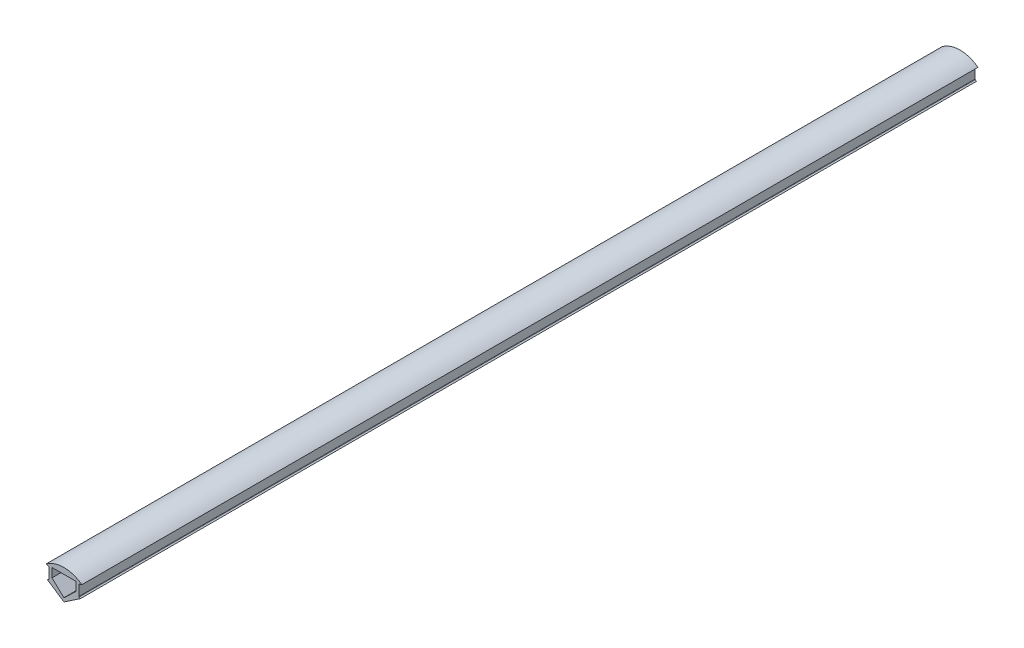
ISO-10303-21;
HEADER;
FILE_DESCRIPTION(('STEP AP214'),'2;1');
FILE_NAME('part.step','',(''),(''),'','','');
FILE_SCHEMA(('AUTOMOTIVE_DESIGN { 1 0 10303 214 1 1 1 1 }'));
ENDSEC;
DATA;
#1=APPLICATION_CONTEXT('core data for automotive mechanical design processes');
#2=APPLICATION_PROTOCOL_DEFINITION('international standard','automotive_design',2000,#1);
#3=PRODUCT_CONTEXT('',#1,'mechanical');
#4=PRODUCT('Part','Part','',(#3));
#5=PRODUCT_RELATED_PRODUCT_CATEGORY('part','',(#4));
#6=PRODUCT_DEFINITION_FORMATION('','',#4);
#7=PRODUCT_DEFINITION_CONTEXT('part definition',#1,'design');
#8=PRODUCT_DEFINITION('design','',#6,#7);
#9=PRODUCT_DEFINITION_SHAPE('','',#8);
#10=(LENGTH_UNIT() NAMED_UNIT(*) SI_UNIT(.MILLI.,.METRE.));
#11=(NAMED_UNIT(*) PLANE_ANGLE_UNIT() SI_UNIT($,.RADIAN.));
#12=(NAMED_UNIT(*) SI_UNIT($,.STERADIAN.) SOLID_ANGLE_UNIT());
#13=UNCERTAINTY_MEASURE_WITH_UNIT(LENGTH_MEASURE(1.E-05),#10,'distance_accuracy_value','');
#14=(GEOMETRIC_REPRESENTATION_CONTEXT(3) GLOBAL_UNCERTAINTY_ASSIGNED_CONTEXT((#13)) GLOBAL_UNIT_ASSIGNED_CONTEXT((#10,
#11,#12)) REPRESENTATION_CONTEXT('',''));
#15=CARTESIAN_POINT('',(0.,0.,0.));
#16=DIRECTION('',(0.,0.,1.));
#17=DIRECTION('',(1.,0.,0.));
#18=AXIS2_PLACEMENT_3D('',#15,#16,#17);
#19=CARTESIAN_POINT('',(5.19999999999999,-0.889002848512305,150.));
#20=DIRECTION('',(0.,0.,1.));
#21=DIRECTION('',(1.,0.,0.));
#22=AXIS2_PLACEMENT_3D('',#19,#20,#21);
#23=PLANE('',#22);
#24=DIRECTION('',(0.,1.,0.));
#25=VECTOR('',#24,1.);
#26=CARTESIAN_POINT('',(4.99999999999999,2.54825155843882,150.));
#27=LINE('',#26,#25);
#28=CARTESIAN_POINT('',(4.99999999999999,-0.889002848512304,150.));
#29=VERTEX_POINT('',#28);
#30=CARTESIAN_POINT('',(4.99999999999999,2.54825155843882,150.));
#31=VERTEX_POINT('',#30);
#32=EDGE_CURVE('E206',#29,#31,#27,.T.);
#33=ORIENTED_EDGE('',*,*,#32,.T.);
#34=CARTESIAN_POINT('',(5.19999999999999,2.54825155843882,150.));
#35=DIRECTION('',(0.,0.,-1.));
#36=DIRECTION('',(-1.,0.,0.));
#37=AXIS2_PLACEMENT_3D('',#34,#35,#36);
#38=CIRCLE('',#37,0.2);
#39=CARTESIAN_POINT('',(5.14192843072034,2.73963518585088,150.));
#40=VERTEX_POINT('',#39);
#41=EDGE_CURVE('E209',#31,#40,#38,.T.);
#42=ORIENTED_EDGE('',*,*,#41,.T.);
#43=DIRECTION('',(0.956918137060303,0.290357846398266,0.));
#44=VECTOR('',#43,1.);
#45=CARTESIAN_POINT('',(6.00000000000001,3.,150.));
#46=LINE('',#45,#44);
#47=CARTESIAN_POINT('',(6.00000000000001,3.,150.));
#48=VERTEX_POINT('',#47);
#49=EDGE_CURVE('E212',#40,#48,#46,.T.);
#50=ORIENTED_EDGE('',*,*,#49,.T.);
#51=CARTESIAN_POINT('',(0.,-5.,150.));
#52=DIRECTION('',(0.,0.,1.));
#53=DIRECTION('',(1.,0.,0.));
#54=AXIS2_PLACEMENT_3D('',#51,#52,#53);
#55=CIRCLE('',#54,10.);
#56=CARTESIAN_POINT('',(-5.99999999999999,2.99999999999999,150.));
#57=VERTEX_POINT('',#56);
#58=EDGE_CURVE('E214',#48,#57,#55,.T.);
#59=ORIENTED_EDGE('',*,*,#58,.T.);
#60=DIRECTION('',(0.956918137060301,-0.290357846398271,0.));
#61=VECTOR('',#60,1.);
#62=CARTESIAN_POINT('',(-5.99999999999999,2.99999999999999,150.));
#63=LINE('',#62,#61);
#64=CARTESIAN_POINT('',(-5.14192843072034,2.73963518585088,150.));
#65=VERTEX_POINT('',#64);
#66=EDGE_CURVE('E216',#57,#65,#63,.T.);
#67=ORIENTED_EDGE('',*,*,#66,.T.);
#68=CARTESIAN_POINT('',(-5.19999999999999,2.54825155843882,150.));
#69=DIRECTION('',(0.,0.,-1.));
#70=DIRECTION('',(1.,0.,0.));
#71=AXIS2_PLACEMENT_3D('',#68,#69,#70);
#72=CIRCLE('',#71,0.2);
#73=CARTESIAN_POINT('',(-4.99999999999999,2.54825155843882,150.));
#74=VERTEX_POINT('',#73);
#75=EDGE_CURVE('E218',#65,#74,#72,.T.);
#76=ORIENTED_EDGE('',*,*,#75,.T.);
#77=DIRECTION('',(0.,-1.,0.));
#78=VECTOR('',#77,1.);
#79=CARTESIAN_POINT('',(-4.99999999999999,2.54825155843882,150.));
#80=LINE('',#79,#78);
#81=CARTESIAN_POINT('',(-4.99999999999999,-0.889002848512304,150.));
#82=VERTEX_POINT('',#81);
#83=EDGE_CURVE('E220',#74,#82,#80,.T.);
#84=ORIENTED_EDGE('',*,*,#83,.T.);
#85=CARTESIAN_POINT('',(-5.19999999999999,-0.889002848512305,150.));
#86=DIRECTION('',(0.,0.,-1.));
#87=DIRECTION('',(1.,0.,0.));
#88=AXIS2_PLACEMENT_3D('',#85,#86,#87);
#89=CIRCLE('',#88,0.2);
#90=CARTESIAN_POINT('',(-5.09419175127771,-1.05872207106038,150.));
#91=VERTEX_POINT('',#90);
#92=EDGE_CURVE('E222',#82,#91,#89,.T.);
#93=ORIENTED_EDGE('',*,*,#92,.T.);
#94=DIRECTION('',(-0.848596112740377,-0.529041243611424,0.));
#95=VECTOR('',#94,1.);
#96=CARTESIAN_POINT('',(-5.09419175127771,-1.05872207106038,150.));
#97=LINE('',#96,#95);
#98=CARTESIAN_POINT('',(-5.50000000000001,-1.31171557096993,150.));
#99=VERTEX_POINT('',#98);
#100=EDGE_CURVE('E224',#91,#99,#97,.T.);
#101=ORIENTED_EDGE('',*,*,#100,.T.);
#102=DIRECTION('',(0.830540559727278,-0.556958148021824,0.));
#103=VECTOR('',#102,1.);
#104=CARTESIAN_POINT('',(-5.50000000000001,-1.31171557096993,150.));
#105=LINE('',#104,#103);
#106=CARTESIAN_POINT('',(0.,-5.,150.));
#107=VERTEX_POINT('',#106);
#108=EDGE_CURVE('E226',#99,#107,#105,.T.);
#109=ORIENTED_EDGE('',*,*,#108,.T.);
#110=DIRECTION('',(0.830540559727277,0.556958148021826,0.));
#111=VECTOR('',#110,1.);
#112=CARTESIAN_POINT('',(5.50000000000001,-1.31171557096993,150.));
#113=LINE('',#112,#111);
#114=CARTESIAN_POINT('',(5.50000000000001,-1.31171557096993,150.));
#115=VERTEX_POINT('',#114);
#116=EDGE_CURVE('E228',#107,#115,#113,.T.);
#117=ORIENTED_EDGE('',*,*,#116,.T.);
#118=DIRECTION('',(-0.848596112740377,0.529041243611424,0.));
#119=VECTOR('',#118,1.);
#120=CARTESIAN_POINT('',(5.09419175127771,-1.05872207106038,150.));
#121=LINE('',#120,#119);
#122=CARTESIAN_POINT('',(5.09419175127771,-1.05872207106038,150.));
#123=VERTEX_POINT('',#122);
#124=EDGE_CURVE('E230',#115,#123,#121,.T.);
#125=ORIENTED_EDGE('',*,*,#124,.T.);
#126=CARTESIAN_POINT('',(5.19999999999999,-0.889002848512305,150.));
#127=DIRECTION('',(0.,0.,-1.));
#128=DIRECTION('',(1.,0.,0.));
#129=AXIS2_PLACEMENT_3D('',#126,#127,#128);
#130=CIRCLE('',#129,0.2);
#131=EDGE_CURVE('E232',#123,#29,#130,.T.);
#132=ORIENTED_EDGE('',*,*,#131,.T.);
#133=EDGE_LOOP('',(#33,#42,#50,#59,#67,#76,#84,#93,#101,#109,#117,#125,#132));
#134=FACE_BOUND('',#133,.T.);
#135=DIRECTION('',(0.729429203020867,0.684056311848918,0.));
#136=VECTOR('',#135,1.);
#137=CARTESIAN_POINT('',(4.,-0.0161479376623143,150.));
#138=LINE('',#137,#136);
#139=CARTESIAN_POINT('',(0.,-3.76733480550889,150.));
#140=VERTEX_POINT('',#139);
#141=CARTESIAN_POINT('',(4.,-0.0161479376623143,150.));
#142=VERTEX_POINT('',#141);
#143=EDGE_CURVE('E170',#140,#142,#138,.T.);
#144=ORIENTED_EDGE('',*,*,#143,.F.);
#145=DIRECTION('',(0.729429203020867,-0.684056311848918,0.));
#146=VECTOR('',#145,1.);
#147=CARTESIAN_POINT('',(-4.,-0.0161479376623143,150.));
#148=LINE('',#147,#146);
#149=CARTESIAN_POINT('',(-4.,-0.0161479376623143,150.));
#150=VERTEX_POINT('',#149);
#151=EDGE_CURVE('E162',#150,#140,#148,.T.);
#152=ORIENTED_EDGE('',*,*,#151,.F.);
#153=DIRECTION('',(0.,-1.,0.));
#154=VECTOR('',#153,1.);
#155=CARTESIAN_POINT('',(-4.,2.99999999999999,150.));
#156=LINE('',#155,#154);
#157=CARTESIAN_POINT('',(-4.,2.99999999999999,150.));
#158=VERTEX_POINT('',#157);
#159=EDGE_CURVE('E189',#158,#150,#156,.T.);
#160=ORIENTED_EDGE('',*,*,#159,.F.);
#161=DIRECTION('',(-1.,0.,0.));
#162=VECTOR('',#161,1.);
#163=CARTESIAN_POINT('',(-4.,2.99999999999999,150.));
#164=LINE('',#163,#162);
#165=CARTESIAN_POINT('',(4.,3.,150.));
#166=VERTEX_POINT('',#165);
#167=EDGE_CURVE('E185',#166,#158,#164,.T.);
#168=ORIENTED_EDGE('',*,*,#167,.F.);
#169=DIRECTION('',(0.,1.,0.));
#170=VECTOR('',#169,1.);
#171=CARTESIAN_POINT('',(4.,3.,150.));
#172=LINE('',#171,#170);
#173=EDGE_CURVE('E183',#142,#166,#172,.T.);
#174=ORIENTED_EDGE('',*,*,#173,.F.);
#175=EDGE_LOOP('',(#144,#152,#160,#168,#174));
#176=FACE_BOUND('',#175,.T.);
#177=ADVANCED_FACE('F37',(#134,#176),#23,.T.);
#178=CARTESIAN_POINT('',(5.19999999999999,-0.889002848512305,-150.));
#179=DIRECTION('',(0.,0.,1.));
#180=DIRECTION('',(1.,0.,0.));
#181=AXIS2_PLACEMENT_3D('',#178,#179,#180);
#182=PLANE('',#181);
#183=CARTESIAN_POINT('',(5.19999999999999,2.54825155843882,-150.));
#184=DIRECTION('',(0.,0.,-1.));
#185=DIRECTION('',(-1.,0.,0.));
#186=AXIS2_PLACEMENT_3D('',#183,#184,#185);
#187=CIRCLE('',#186,0.2);
#188=CARTESIAN_POINT('',(4.99999999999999,2.54825155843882,-150.));
#189=VERTEX_POINT('',#188);
#190=CARTESIAN_POINT('',(5.14192843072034,2.73963518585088,-150.));
#191=VERTEX_POINT('',#190);
#192=EDGE_CURVE('E178',#189,#191,#187,.T.);
#193=ORIENTED_EDGE('',*,*,#192,.F.);
#194=DIRECTION('',(0.,1.,0.));
#195=VECTOR('',#194,1.);
#196=CARTESIAN_POINT('',(4.99999999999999,-0.889002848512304,-150.));
#197=LINE('',#196,#195);
#198=CARTESIAN_POINT('',(4.99999999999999,-0.889002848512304,-150.));
#199=VERTEX_POINT('',#198);
#200=EDGE_CURVE('E210',#199,#189,#197,.T.);
#201=ORIENTED_EDGE('',*,*,#200,.F.);
#202=CARTESIAN_POINT('',(5.19999999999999,-0.889002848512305,-150.));
#203=DIRECTION('',(0.,0.,-1.));
#204=DIRECTION('',(1.,0.,0.));
#205=AXIS2_PLACEMENT_3D('',#202,#203,#204);
#206=CIRCLE('',#205,0.2);
#207=CARTESIAN_POINT('',(5.09419175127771,-1.05872207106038,-150.));
#208=VERTEX_POINT('',#207);
#209=EDGE_CURVE('E258',#208,#199,#206,.T.);
#210=ORIENTED_EDGE('',*,*,#209,.F.);
#211=DIRECTION('',(-0.848596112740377,0.529041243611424,0.));
#212=VECTOR('',#211,1.);
#213=CARTESIAN_POINT('',(5.09419175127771,-1.05872207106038,-150.));
#214=LINE('',#213,#212);
#215=CARTESIAN_POINT('',(5.50000000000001,-1.31171557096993,-150.));
#216=VERTEX_POINT('',#215);
#217=EDGE_CURVE('E256',#216,#208,#214,.T.);
#218=ORIENTED_EDGE('',*,*,#217,.F.);
#219=DIRECTION('',(0.830540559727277,0.556958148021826,0.));
#220=VECTOR('',#219,1.);
#221=CARTESIAN_POINT('',(5.50000000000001,-1.31171557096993,-150.));
#222=LINE('',#221,#220);
#223=CARTESIAN_POINT('',(0.,-5.,-150.));
#224=VERTEX_POINT('',#223);
#225=EDGE_CURVE('E254',#224,#216,#222,.T.);
#226=ORIENTED_EDGE('',*,*,#225,.F.);
#227=DIRECTION('',(0.830540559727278,-0.556958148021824,0.));
#228=VECTOR('',#227,1.);
#229=CARTESIAN_POINT('',(-5.50000000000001,-1.31171557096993,-150.));
#230=LINE('',#229,#228);
#231=CARTESIAN_POINT('',(-5.50000000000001,-1.31171557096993,-150.));
#232=VERTEX_POINT('',#231);
#233=EDGE_CURVE('E252',#232,#224,#230,.T.);
#234=ORIENTED_EDGE('',*,*,#233,.F.);
#235=DIRECTION('',(-0.848596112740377,-0.529041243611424,0.));
#236=VECTOR('',#235,1.);
#237=CARTESIAN_POINT('',(-5.09419175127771,-1.05872207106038,-150.));
#238=LINE('',#237,#236);
#239=CARTESIAN_POINT('',(-5.09419175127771,-1.05872207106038,-150.));
#240=VERTEX_POINT('',#239);
#241=EDGE_CURVE('E250',#240,#232,#238,.T.);
#242=ORIENTED_EDGE('',*,*,#241,.F.);
#243=CARTESIAN_POINT('',(-5.19999999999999,-0.889002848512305,-150.));
#244=DIRECTION('',(0.,0.,-1.));
#245=DIRECTION('',(1.,0.,0.));
#246=AXIS2_PLACEMENT_3D('',#243,#244,#245);
#247=CIRCLE('',#246,0.2);
#248=CARTESIAN_POINT('',(-4.99999999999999,-0.889002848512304,-150.));
#249=VERTEX_POINT('',#248);
#250=EDGE_CURVE('E248',#249,#240,#247,.T.);
#251=ORIENTED_EDGE('',*,*,#250,.F.);
#252=DIRECTION('',(0.,-1.,0.));
#253=VECTOR('',#252,1.);
#254=CARTESIAN_POINT('',(-4.99999999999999,-0.889002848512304,-150.));
#255=LINE('',#254,#253);
#256=CARTESIAN_POINT('',(-4.99999999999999,2.54825155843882,-150.));
#257=VERTEX_POINT('',#256);
#258=EDGE_CURVE('E246',#257,#249,#255,.T.);
#259=ORIENTED_EDGE('',*,*,#258,.F.);
#260=CARTESIAN_POINT('',(-5.19999999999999,2.54825155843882,-150.));
#261=DIRECTION('',(0.,0.,-1.));
#262=DIRECTION('',(1.,0.,0.));
#263=AXIS2_PLACEMENT_3D('',#260,#261,#262);
#264=CIRCLE('',#263,0.2);
#265=CARTESIAN_POINT('',(-5.14192843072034,2.73963518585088,-150.));
#266=VERTEX_POINT('',#265);
#267=EDGE_CURVE('E243',#266,#257,#264,.T.);
#268=ORIENTED_EDGE('',*,*,#267,.F.);
#269=DIRECTION('',(0.956918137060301,-0.290357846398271,0.));
#270=VECTOR('',#269,1.);
#271=CARTESIAN_POINT('',(-5.99999999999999,2.99999999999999,-150.));
#272=LINE('',#271,#270);
#273=CARTESIAN_POINT('',(-5.99999999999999,2.99999999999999,-150.));
#274=VERTEX_POINT('',#273);
#275=EDGE_CURVE('E241',#274,#266,#272,.T.);
#276=ORIENTED_EDGE('',*,*,#275,.F.);
#277=CARTESIAN_POINT('',(0.,-5.,-150.));
#278=DIRECTION('',(0.,0.,1.));
#279=DIRECTION('',(1.,0.,0.));
#280=AXIS2_PLACEMENT_3D('',#277,#278,#279);
#281=CIRCLE('',#280,10.);
#282=CARTESIAN_POINT('',(6.00000000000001,3.,-150.));
#283=VERTEX_POINT('',#282);
#284=EDGE_CURVE('E239',#283,#274,#281,.T.);
#285=ORIENTED_EDGE('',*,*,#284,.F.);
#286=DIRECTION('',(0.956918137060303,0.290357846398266,0.));
#287=VECTOR('',#286,1.);
#288=CARTESIAN_POINT('',(6.00000000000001,3.,-150.));
#289=LINE('',#288,#287);
#290=EDGE_CURVE('E237',#191,#283,#289,.T.);
#291=ORIENTED_EDGE('',*,*,#290,.F.);
#292=EDGE_LOOP('',(#193,#201,#210,#218,#226,#234,#242,#251,#259,#268,#276,#285,#291));
#293=FACE_BOUND('',#292,.T.);
#294=DIRECTION('',(0.729429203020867,-0.684056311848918,0.));
#295=VECTOR('',#294,1.);
#296=CARTESIAN_POINT('',(-4.,-0.0161479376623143,-150.));
#297=LINE('',#296,#295);
#298=CARTESIAN_POINT('',(-4.,-0.0161479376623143,-150.));
#299=VERTEX_POINT('',#298);
#300=CARTESIAN_POINT('',(0.,-3.76733480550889,-150.));
#301=VERTEX_POINT('',#300);
#302=EDGE_CURVE('E60',#299,#301,#297,.T.);
#303=ORIENTED_EDGE('',*,*,#302,.T.);
#304=DIRECTION('',(0.729429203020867,0.684056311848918,0.));
#305=VECTOR('',#304,1.);
#306=CARTESIAN_POINT('',(4.,-0.0161479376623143,-150.));
#307=LINE('',#306,#305);
#308=CARTESIAN_POINT('',(4.,-0.0161479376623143,-150.));
#309=VERTEX_POINT('',#308);
#310=EDGE_CURVE('E177',#301,#309,#307,.T.);
#311=ORIENTED_EDGE('',*,*,#310,.T.);
#312=DIRECTION('',(0.,1.,0.));
#313=VECTOR('',#312,1.);
#314=CARTESIAN_POINT('',(4.,3.,-150.));
#315=LINE('',#314,#313);
#316=CARTESIAN_POINT('',(4.,3.,-150.));
#317=VERTEX_POINT('',#316);
#318=EDGE_CURVE('E193',#309,#317,#315,.T.);
#319=ORIENTED_EDGE('',*,*,#318,.T.);
#320=DIRECTION('',(-1.,0.,0.));
#321=VECTOR('',#320,1.);
#322=CARTESIAN_POINT('',(-4.,2.99999999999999,-150.));
#323=LINE('',#322,#321);
#324=CARTESIAN_POINT('',(-4.,2.99999999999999,-150.));
#325=VERTEX_POINT('',#324);
#326=EDGE_CURVE('E196',#317,#325,#323,.T.);
#327=ORIENTED_EDGE('',*,*,#326,.T.);
#328=DIRECTION('',(0.,-1.,0.));
#329=VECTOR('',#328,1.);
#330=CARTESIAN_POINT('',(-4.,2.99999999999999,-150.));
#331=LINE('',#330,#329);
#332=EDGE_CURVE('E171',#325,#299,#331,.T.);
#333=ORIENTED_EDGE('',*,*,#332,.T.);
#334=EDGE_LOOP('',(#303,#311,#319,#327,#333));
#335=FACE_BOUND('',#334,.T.);
#336=ADVANCED_FACE('F303',(#293,#335),#182,.F.);
#337=CARTESIAN_POINT('',(5.19999999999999,2.54825155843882,150.));
#338=DIRECTION('',(0.,0.,-1.));
#339=DIRECTION('',(-1.,0.,0.));
#340=AXIS2_PLACEMENT_3D('',#337,#338,#339);
#341=CYLINDRICAL_SURFACE('',#340,0.2);
#342=ORIENTED_EDGE('',*,*,#192,.T.);
#343=DIRECTION('',(0.,0.,-1.));
#344=VECTOR('',#343,1.);
#345=CARTESIAN_POINT('',(5.14192843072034,2.73963518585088,150.));
#346=LINE('',#345,#344);
#347=EDGE_CURVE('E45',#40,#191,#346,.T.);
#348=ORIENTED_EDGE('',*,*,#347,.F.);
#349=ORIENTED_EDGE('',*,*,#41,.F.);
#350=DIRECTION('',(0.,0.,-1.));
#351=VECTOR('',#350,1.);
#352=CARTESIAN_POINT('',(4.99999999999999,2.54825155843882,150.));
#353=LINE('',#352,#351);
#354=EDGE_CURVE('E11',#31,#189,#353,.T.);
#355=ORIENTED_EDGE('',*,*,#354,.T.);
#356=EDGE_LOOP('',(#342,#348,#349,#355));
#357=FACE_BOUND('',#356,.T.);
#358=ADVANCED_FACE('F39',(#357),#341,.F.);
#359=CARTESIAN_POINT('',(6.00000000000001,3.,150.));
#360=DIRECTION('',(-0.290357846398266,0.956918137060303,0.));
#361=DIRECTION('',(-0.956918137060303,-0.290357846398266,0.));
#362=AXIS2_PLACEMENT_3D('',#359,#360,#361);
#363=PLANE('',#362);
#364=ORIENTED_EDGE('',*,*,#290,.T.);
#365=DIRECTION('',(0.,0.,-1.));
#366=VECTOR('',#365,1.);
#367=CARTESIAN_POINT('',(6.00000000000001,3.,150.));
#368=LINE('',#367,#366);
#369=EDGE_CURVE('E290',#48,#283,#368,.T.);
#370=ORIENTED_EDGE('',*,*,#369,.F.);
#371=ORIENTED_EDGE('',*,*,#49,.F.);
#372=ORIENTED_EDGE('',*,*,#347,.T.);
#373=EDGE_LOOP('',(#364,#370,#371,#372));
#374=FACE_BOUND('',#373,.T.);
#375=ADVANCED_FACE('F297',(#374),#363,.F.);
#376=CARTESIAN_POINT('',(0.,-5.,150.));
#377=DIRECTION('',(0.,0.,-1.));
#378=DIRECTION('',(-1.,0.,0.));
#379=AXIS2_PLACEMENT_3D('',#376,#377,#378);
#380=CYLINDRICAL_SURFACE('',#379,10.);
#381=ORIENTED_EDGE('',*,*,#284,.T.);
#382=DIRECTION('',(0.,0.,-1.));
#383=VECTOR('',#382,1.);
#384=CARTESIAN_POINT('',(-5.99999999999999,2.99999999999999,150.));
#385=LINE('',#384,#383);
#386=EDGE_CURVE('E287',#57,#274,#385,.T.);
#387=ORIENTED_EDGE('',*,*,#386,.F.);
#388=ORIENTED_EDGE('',*,*,#58,.F.);
#389=ORIENTED_EDGE('',*,*,#369,.T.);
#390=EDGE_LOOP('',(#381,#387,#388,#389));
#391=FACE_BOUND('',#390,.T.);
#392=ADVANCED_FACE('F310',(#391),#380,.T.);
#393=CARTESIAN_POINT('',(-5.99999999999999,2.99999999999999,150.));
#394=DIRECTION('',(0.290357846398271,0.956918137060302,0.));
#395=DIRECTION('',(-0.956918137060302,0.290357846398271,0.));
#396=AXIS2_PLACEMENT_3D('',#393,#394,#395);
#397=PLANE('',#396);
#398=ORIENTED_EDGE('',*,*,#275,.T.);
#399=DIRECTION('',(0.,0.,-1.));
#400=VECTOR('',#399,1.);
#401=CARTESIAN_POINT('',(-5.14192843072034,2.73963518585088,150.));
#402=LINE('',#401,#400);
#403=EDGE_CURVE('E284',#65,#266,#402,.T.);
#404=ORIENTED_EDGE('',*,*,#403,.F.);
#405=ORIENTED_EDGE('',*,*,#66,.F.);
#406=ORIENTED_EDGE('',*,*,#386,.T.);
#407=EDGE_LOOP('',(#398,#404,#405,#406));
#408=FACE_BOUND('',#407,.T.);
#409=ADVANCED_FACE('F314',(#408),#397,.F.);
#410=CARTESIAN_POINT('',(-5.19999999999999,2.54825155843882,150.));
#411=DIRECTION('',(0.,0.,-1.));
#412=DIRECTION('',(-1.,0.,0.));
#413=AXIS2_PLACEMENT_3D('',#410,#411,#412);
#414=CYLINDRICAL_SURFACE('',#413,0.2);
#415=ORIENTED_EDGE('',*,*,#267,.T.);
#416=DIRECTION('',(0.,0.,-1.));
#417=VECTOR('',#416,1.);
#418=CARTESIAN_POINT('',(-4.99999999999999,2.54825155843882,150.));
#419=LINE('',#418,#417);
#420=EDGE_CURVE('E281',#74,#257,#419,.T.);
#421=ORIENTED_EDGE('',*,*,#420,.F.);
#422=ORIENTED_EDGE('',*,*,#75,.F.);
#423=ORIENTED_EDGE('',*,*,#403,.T.);
#424=EDGE_LOOP('',(#415,#421,#422,#423));
#425=FACE_BOUND('',#424,.T.);
#426=ADVANCED_FACE('F355',(#425),#414,.F.);
#427=CARTESIAN_POINT('',(-4.99999999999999,-0.889002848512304,150.));
#428=DIRECTION('',(1.,0.,0.));
#429=DIRECTION('',(0.,0.,-1.));
#430=AXIS2_PLACEMENT_3D('',#427,#428,#429);
#431=PLANE('',#430);
#432=ORIENTED_EDGE('',*,*,#258,.T.);
#433=DIRECTION('',(0.,0.,-1.));
#434=VECTOR('',#433,1.);
#435=CARTESIAN_POINT('',(-4.99999999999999,-0.889002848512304,150.));
#436=LINE('',#435,#434);
#437=EDGE_CURVE('E278',#82,#249,#436,.T.);
#438=ORIENTED_EDGE('',*,*,#437,.F.);
#439=ORIENTED_EDGE('',*,*,#83,.F.);
#440=ORIENTED_EDGE('',*,*,#420,.T.);
#441=EDGE_LOOP('',(#432,#438,#439,#440));
#442=FACE_BOUND('',#441,.T.);
#443=ADVANCED_FACE('F357',(#442),#431,.F.);
#444=CARTESIAN_POINT('',(-5.19999999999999,-0.889002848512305,150.));
#445=DIRECTION('',(0.,0.,-1.));
#446=DIRECTION('',(-1.,0.,0.));
#447=AXIS2_PLACEMENT_3D('',#444,#445,#446);
#448=CYLINDRICAL_SURFACE('',#447,0.2);
#449=ORIENTED_EDGE('',*,*,#250,.T.);
#450=DIRECTION('',(0.,0.,-1.));
#451=VECTOR('',#450,1.);
#452=CARTESIAN_POINT('',(-5.09419175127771,-1.05872207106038,150.));
#453=LINE('',#452,#451);
#454=EDGE_CURVE('E275',#91,#240,#453,.T.);
#455=ORIENTED_EDGE('',*,*,#454,.F.);
#456=ORIENTED_EDGE('',*,*,#92,.F.);
#457=ORIENTED_EDGE('',*,*,#437,.T.);
#458=EDGE_LOOP('',(#449,#455,#456,#457));
#459=FACE_BOUND('',#458,.T.);
#460=ADVANCED_FACE('F351',(#459),#448,.F.);
#461=CARTESIAN_POINT('',(-5.09419175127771,-1.05872207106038,150.));
#462=DIRECTION('',(0.529041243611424,-0.848596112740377,0.));
#463=DIRECTION('',(0.848596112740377,0.529041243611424,0.));
#464=AXIS2_PLACEMENT_3D('',#461,#462,#463);
#465=PLANE('',#464);
#466=ORIENTED_EDGE('',*,*,#241,.T.);
#467=DIRECTION('',(0.,0.,-1.));
#468=VECTOR('',#467,1.);
#469=CARTESIAN_POINT('',(-5.50000000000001,-1.31171557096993,150.));
#470=LINE('',#469,#468);
#471=EDGE_CURVE('E272',#99,#232,#470,.T.);
#472=ORIENTED_EDGE('',*,*,#471,.F.);
#473=ORIENTED_EDGE('',*,*,#100,.F.);
#474=ORIENTED_EDGE('',*,*,#454,.T.);
#475=EDGE_LOOP('',(#466,#472,#473,#474));
#476=FACE_BOUND('',#475,.T.);
#477=ADVANCED_FACE('F347',(#476),#465,.F.);
#478=CARTESIAN_POINT('',(-5.50000000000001,-1.31171557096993,150.));
#479=DIRECTION('',(0.556958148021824,0.830540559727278,0.));
#480=DIRECTION('',(-0.830540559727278,0.556958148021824,0.));
#481=AXIS2_PLACEMENT_3D('',#478,#479,#480);
#482=PLANE('',#481);
#483=ORIENTED_EDGE('',*,*,#233,.T.);
#484=DIRECTION('',(0.,0.,-1.));
#485=VECTOR('',#484,1.);
#486=CARTESIAN_POINT('',(0.,-5.,150.));
#487=LINE('',#486,#485);
#488=EDGE_CURVE('E269',#107,#224,#487,.T.);
#489=ORIENTED_EDGE('',*,*,#488,.F.);
#490=ORIENTED_EDGE('',*,*,#108,.F.);
#491=ORIENTED_EDGE('',*,*,#471,.T.);
#492=EDGE_LOOP('',(#483,#489,#490,#491));
#493=FACE_BOUND('',#492,.T.);
#494=ADVANCED_FACE('F342',(#493),#482,.F.);
#495=CARTESIAN_POINT('',(5.50000000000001,-1.31171557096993,150.));
#496=DIRECTION('',(-0.556958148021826,0.830540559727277,0.));
#497=DIRECTION('',(-0.830540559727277,-0.556958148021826,0.));
#498=AXIS2_PLACEMENT_3D('',#495,#496,#497);
#499=PLANE('',#498);
#500=ORIENTED_EDGE('',*,*,#225,.T.);
#501=DIRECTION('',(0.,0.,-1.));
#502=VECTOR('',#501,1.);
#503=CARTESIAN_POINT('',(5.50000000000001,-1.31171557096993,150.));
#504=LINE('',#503,#502);
#505=EDGE_CURVE('E266',#115,#216,#504,.T.);
#506=ORIENTED_EDGE('',*,*,#505,.F.);
#507=ORIENTED_EDGE('',*,*,#116,.F.);
#508=ORIENTED_EDGE('',*,*,#488,.T.);
#509=EDGE_LOOP('',(#500,#506,#507,#508));
#510=FACE_BOUND('',#509,.T.);
#511=ADVANCED_FACE('F336',(#510),#499,.F.);
#512=CARTESIAN_POINT('',(5.09419175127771,-1.05872207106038,150.));
#513=DIRECTION('',(-0.529041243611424,-0.848596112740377,0.));
#514=DIRECTION('',(0.848596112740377,-0.529041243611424,0.));
#515=AXIS2_PLACEMENT_3D('',#512,#513,#514);
#516=PLANE('',#515);
#517=ORIENTED_EDGE('',*,*,#217,.T.);
#518=DIRECTION('',(0.,0.,-1.));
#519=VECTOR('',#518,1.);
#520=CARTESIAN_POINT('',(5.09419175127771,-1.05872207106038,150.));
#521=LINE('',#520,#519);
#522=EDGE_CURVE('E263',#123,#208,#521,.T.);
#523=ORIENTED_EDGE('',*,*,#522,.F.);
#524=ORIENTED_EDGE('',*,*,#124,.F.);
#525=ORIENTED_EDGE('',*,*,#505,.T.);
#526=EDGE_LOOP('',(#517,#523,#524,#525));
#527=FACE_BOUND('',#526,.T.);
#528=ADVANCED_FACE('F332',(#527),#516,.F.);
#529=CARTESIAN_POINT('',(5.19999999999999,-0.889002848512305,150.));
#530=DIRECTION('',(0.,0.,-1.));
#531=DIRECTION('',(-1.,0.,0.));
#532=AXIS2_PLACEMENT_3D('',#529,#530,#531);
#533=CYLINDRICAL_SURFACE('',#532,0.2);
#534=ORIENTED_EDGE('',*,*,#209,.T.);
#535=DIRECTION('',(0.,0.,-1.));
#536=VECTOR('',#535,1.);
#537=CARTESIAN_POINT('',(4.99999999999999,-0.889002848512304,150.));
#538=LINE('',#537,#536);
#539=EDGE_CURVE('E235',#29,#199,#538,.T.);
#540=ORIENTED_EDGE('',*,*,#539,.F.);
#541=ORIENTED_EDGE('',*,*,#131,.F.);
#542=ORIENTED_EDGE('',*,*,#522,.T.);
#543=EDGE_LOOP('',(#534,#540,#541,#542));
#544=FACE_BOUND('',#543,.T.);
#545=ADVANCED_FACE('F327',(#544),#533,.F.);
#546=CARTESIAN_POINT('',(4.99999999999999,-0.889002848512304,150.));
#547=DIRECTION('',(-1.,0.,0.));
#548=DIRECTION('',(0.,0.,1.));
#549=AXIS2_PLACEMENT_3D('',#546,#547,#548);
#550=PLANE('',#549);
#551=ORIENTED_EDGE('',*,*,#200,.T.);
#552=ORIENTED_EDGE('',*,*,#354,.F.);
#553=ORIENTED_EDGE('',*,*,#32,.F.);
#554=ORIENTED_EDGE('',*,*,#539,.T.);
#555=EDGE_LOOP('',(#551,#552,#553,#554));
#556=FACE_BOUND('',#555,.T.);
#557=ADVANCED_FACE('F321',(#556),#550,.F.);
#558=CARTESIAN_POINT('',(-4.,-0.0161479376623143,150.));
#559=DIRECTION('',(0.684056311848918,0.729429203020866,0.));
#560=DIRECTION('',(-0.729429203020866,0.684056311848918,0.));
#561=AXIS2_PLACEMENT_3D('',#558,#559,#560);
#562=PLANE('',#561);
#563=ORIENTED_EDGE('',*,*,#302,.F.);
#564=DIRECTION('',(0.,0.,-1.));
#565=VECTOR('',#564,1.);
#566=CARTESIAN_POINT('',(-4.,-0.0161479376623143,150.));
#567=LINE('',#566,#565);
#568=EDGE_CURVE('E166',#150,#299,#567,.T.);
#569=ORIENTED_EDGE('',*,*,#568,.F.);
#570=ORIENTED_EDGE('',*,*,#151,.T.);
#571=DIRECTION('',(0.,0.,-1.));
#572=VECTOR('',#571,1.);
#573=CARTESIAN_POINT('',(0.,-3.76733480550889,150.));
#574=LINE('',#573,#572);
#575=EDGE_CURVE('E165',#140,#301,#574,.T.);
#576=ORIENTED_EDGE('',*,*,#575,.T.);
#577=EDGE_LOOP('',(#563,#569,#570,#576));
#578=FACE_BOUND('',#577,.T.);
#579=ADVANCED_FACE('F164',(#578),#562,.T.);
#580=CARTESIAN_POINT('',(4.,-0.0161479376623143,150.));
#581=DIRECTION('',(-0.684056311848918,0.729429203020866,0.));
#582=DIRECTION('',(-0.729429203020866,-0.684056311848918,0.));
#583=AXIS2_PLACEMENT_3D('',#580,#581,#582);
#584=PLANE('',#583);
#585=ORIENTED_EDGE('',*,*,#310,.F.);
#586=ORIENTED_EDGE('',*,*,#575,.F.);
#587=ORIENTED_EDGE('',*,*,#143,.T.);
#588=DIRECTION('',(0.,0.,-1.));
#589=VECTOR('',#588,1.);
#590=CARTESIAN_POINT('',(4.,-0.0161479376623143,150.));
#591=LINE('',#590,#589);
#592=EDGE_CURVE('E179',#142,#309,#591,.T.);
#593=ORIENTED_EDGE('',*,*,#592,.T.);
#594=EDGE_LOOP('',(#585,#586,#587,#593));
#595=FACE_BOUND('',#594,.T.);
#596=ADVANCED_FACE('F174',(#595),#584,.T.);
#597=CARTESIAN_POINT('',(4.,3.,150.));
#598=DIRECTION('',(-1.,0.,0.));
#599=DIRECTION('',(0.,-1.,0.));
#600=AXIS2_PLACEMENT_3D('',#597,#598,#599);
#601=PLANE('',#600);
#602=ORIENTED_EDGE('',*,*,#318,.F.);
#603=ORIENTED_EDGE('',*,*,#592,.F.);
#604=ORIENTED_EDGE('',*,*,#173,.T.);
#605=DIRECTION('',(0.,0.,-1.));
#606=VECTOR('',#605,1.);
#607=CARTESIAN_POINT('',(4.,3.,150.));
#608=LINE('',#607,#606);
#609=EDGE_CURVE('E203',#166,#317,#608,.T.);
#610=ORIENTED_EDGE('',*,*,#609,.T.);
#611=EDGE_LOOP('',(#602,#603,#604,#610));
#612=FACE_BOUND('',#611,.T.);
#613=ADVANCED_FACE('F421',(#612),#601,.T.);
#614=CARTESIAN_POINT('',(-4.,2.99999999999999,150.));
#615=DIRECTION('',(0.,-1.,0.));
#616=DIRECTION('',(1.,0.,0.));
#617=AXIS2_PLACEMENT_3D('',#614,#615,#616);
#618=PLANE('',#617);
#619=ORIENTED_EDGE('',*,*,#326,.F.);
#620=ORIENTED_EDGE('',*,*,#609,.F.);
#621=ORIENTED_EDGE('',*,*,#167,.T.);
#622=DIRECTION('',(0.,0.,-1.));
#623=VECTOR('',#622,1.);
#624=CARTESIAN_POINT('',(-4.,2.99999999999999,150.));
#625=LINE('',#624,#623);
#626=EDGE_CURVE('E52',#158,#325,#625,.T.);
#627=ORIENTED_EDGE('',*,*,#626,.T.);
#628=EDGE_LOOP('',(#619,#620,#621,#627));
#629=FACE_BOUND('',#628,.T.);
#630=ADVANCED_FACE('F427',(#629),#618,.T.);
#631=CARTESIAN_POINT('',(-4.,2.99999999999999,150.));
#632=DIRECTION('',(1.,0.,0.));
#633=DIRECTION('',(0.,0.,-1.));
#634=AXIS2_PLACEMENT_3D('',#631,#632,#633);
#635=PLANE('',#634);
#636=ORIENTED_EDGE('',*,*,#332,.F.);
#637=ORIENTED_EDGE('',*,*,#626,.F.);
#638=ORIENTED_EDGE('',*,*,#159,.T.);
#639=ORIENTED_EDGE('',*,*,#568,.T.);
#640=EDGE_LOOP('',(#636,#637,#638,#639));
#641=FACE_BOUND('',#640,.T.);
#642=ADVANCED_FACE('F435',(#641),#635,.T.);
#643=CLOSED_SHELL('',(#177,#336,#358,#375,#392,#409,#426,#443,#460,#477,#494,#511,#528,#545,
#557,#579,#596,#613,#630,#642));
#644=MANIFOLD_SOLID_BREP('B2',#643);
#645=ADVANCED_BREP_SHAPE_REPRESENTATION('',(#18,#644),#14);
#646=SHAPE_DEFINITION_REPRESENTATION(#9,#645);
ENDSEC;
END-ISO-10303-21;
